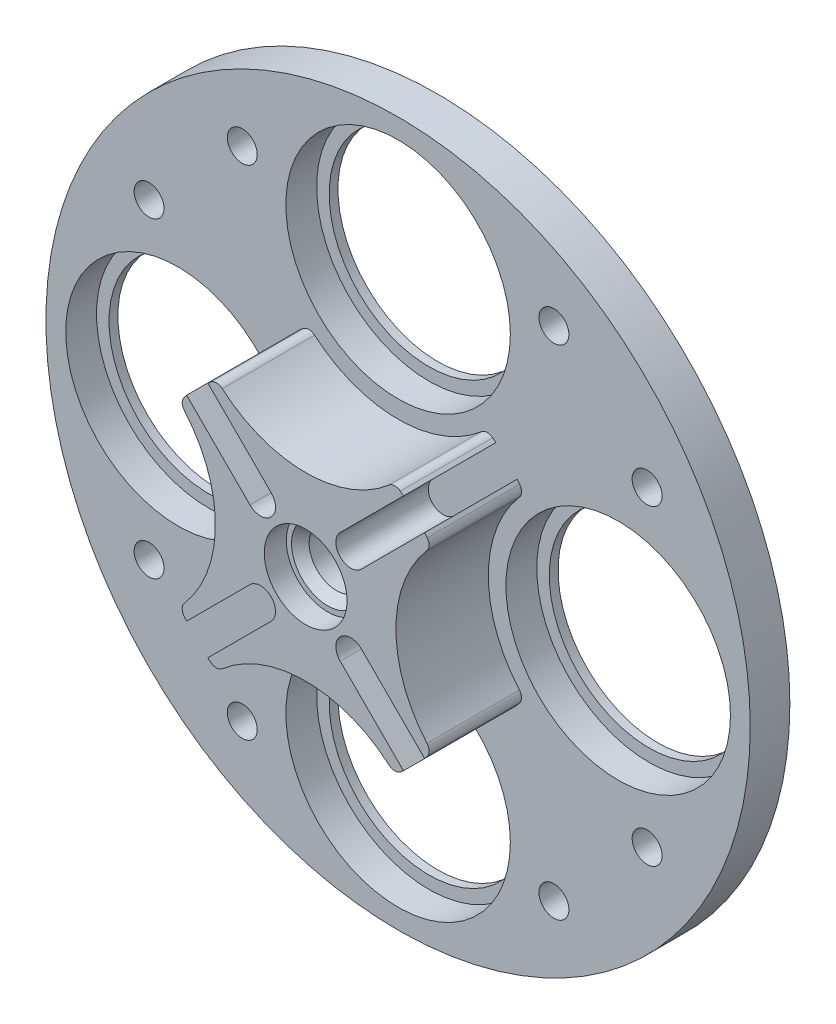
from build123d import *

# Parameters (mm, degrees)
SKETCH2_R           = 40
SKETCH2_R_2         = 11.33
SKETCH2_R_3         = 3.1
SKETCH2_R_4         = 1.7
BOSS_EXTRUDE1_DEPTH = 1
SKETCH3_R           = 40
SKETCH3_R_2         = 12.75
SKETCH3_R_3         = 3.1
SKETCH3_R_4         = 1.7
BOSS_EXTRUDE2_DEPTH = 3.5
SKETCH4_R           = 3.1
BOSS_EXTRUDE3_DEPTH = 10.5
SKETCH6_R           = 4.7
CUT_EXTRUDE2_DEPTH  = 2.5
CHAMFER1_SIZE       = 1
CUT_EXTRUDE1_DEPTH  = 2.1
FILLET1_R           = 1


with BuildPart() as part:
    # Sketch2 → Boss-Extrude1 (new body)
    with BuildSketch(Plane.XY):
        Circle(SKETCH2_R)
        with Locations((0, 25)):
            Circle(SKETCH2_R_2, mode=Mode.SUBTRACT)
        with Locations((25, 0)):
            Circle(SKETCH2_R_2, mode=Mode.SUBTRACT)
        with Locations((0, -25)):
            Circle(SKETCH2_R_2, mode=Mode.SUBTRACT)
        with Locations((-25, 0)):
            Circle(SKETCH2_R_2, mode=Mode.SUBTRACT)
        Circle(SKETCH2_R_3, mode=Mode.SUBTRACT)
        with Locations((17.697840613, 28.284271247)):
            Circle(SKETCH2_R_4, mode=Mode.SUBTRACT)
        with Locations((-17.697840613, 28.284271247)):
            Circle(SKETCH2_R_4, mode=Mode.SUBTRACT)
        with Locations((28.284271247, -17.697840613)):
            Circle(SKETCH2_R_4, mode=Mode.SUBTRACT)
        with Locations((28.284271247, 17.697840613)):
            Circle(SKETCH2_R_4, mode=Mode.SUBTRACT)
        with Locations((-17.697840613, -28.284271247)):
            Circle(SKETCH2_R_4, mode=Mode.SUBTRACT)
        with Locations((17.697840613, -28.284271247)):
            Circle(SKETCH2_R_4, mode=Mode.SUBTRACT)
        with Locations((-28.284271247, 17.697840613)):
            Circle(SKETCH2_R_4, mode=Mode.SUBTRACT)
        with Locations((-28.284271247, -17.697840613)):
            Circle(SKETCH2_R_4, mode=Mode.SUBTRACT)
    extrude(amount=BOSS_EXTRUDE1_DEPTH)

    # Sketch3 → Boss-Extrude2 (add)
    with BuildSketch(Plane.XY.offset(1)):
        Circle(SKETCH3_R)
        with Locations((0, 25)):
            Circle(SKETCH3_R_2, mode=Mode.SUBTRACT)
        with Locations((25, 0)):
            Circle(SKETCH3_R_2, mode=Mode.SUBTRACT)
        with Locations((0, -25)):
            Circle(SKETCH3_R_2, mode=Mode.SUBTRACT)
        with Locations((-25, 0)):
            Circle(SKETCH3_R_2, mode=Mode.SUBTRACT)
        Circle(SKETCH3_R_3, mode=Mode.SUBTRACT)
        with Locations((17.697840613, 28.284271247)):
            Circle(SKETCH3_R_4, mode=Mode.SUBTRACT)
        with Locations((-17.697840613, 28.284271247)):
            Circle(SKETCH3_R_4, mode=Mode.SUBTRACT)
        with Locations((28.284271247, -17.697840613)):
            Circle(SKETCH3_R_4, mode=Mode.SUBTRACT)
        with Locations((28.284271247, 17.697840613)):
            Circle(SKETCH3_R_4, mode=Mode.SUBTRACT)
        with Locations((-17.697840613, -28.284271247)):
            Circle(SKETCH3_R_4, mode=Mode.SUBTRACT)
        with Locations((17.697840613, -28.284271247)):
            Circle(SKETCH3_R_4, mode=Mode.SUBTRACT)
        with Locations((-28.284271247, 17.697840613)):
            Circle(SKETCH3_R_4, mode=Mode.SUBTRACT)
        with Locations((-28.284271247, -17.697840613)):
            Circle(SKETCH3_R_4, mode=Mode.SUBTRACT)
    extrude(amount=BOSS_EXTRUDE2_DEPTH)

    # Sketch4 → Boss-Extrude3 (add)
    with BuildSketch(Plane.XY.offset(4.5)):
        with BuildLine():
            Line((11.113761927, 13.517924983), (3.923549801, 6.327712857))
            ThreePointArc((3.923549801, 6.327712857), (3.923549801, 3.923549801), (6.327712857, 3.923549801))
            Line((6.327712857, 3.923549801), (13.517924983, 11.113761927))
            ThreePointArc((13.517924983, 11.113761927), (13.925714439, 10.598324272), (14.313861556, 10.067937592))
            ThreePointArc((14.313861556, 10.067937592), (10.248737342, 0), (14.313861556, -10.067937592))
            ThreePointArc((14.313861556, -10.067937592), (13.925714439, -10.598324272), (13.517924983, -11.113761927))
            Line((13.517924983, -11.113761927), (6.327712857, -3.923549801))
            ThreePointArc((6.327712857, -3.923549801), (3.923549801, -3.923549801), (3.923549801, -6.327712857))
            Line((3.923549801, -6.327712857), (11.113761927, -13.517924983))
            ThreePointArc((11.113761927, -13.517924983), (10.598324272, -13.925714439), (10.067937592, -14.313861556))
            ThreePointArc((10.067937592, -14.313861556), (0, -10.248737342), (-10.067937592, -14.313861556))
            ThreePointArc((-10.067937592, -14.313861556), (-10.598324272, -13.925714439), (-11.113761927, -13.517924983))
            Line((-11.113761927, -13.517924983), (-3.923549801, -6.327712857))
            ThreePointArc((-3.923549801, -6.327712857), (-3.923549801, -3.923549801), (-6.327712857, -3.923549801))
            Line((-6.327712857, -3.923549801), (-13.517924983, -11.113761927))
            ThreePointArc((-13.517924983, -11.113761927), (-13.925714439, -10.598324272), (-14.313861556, -10.067937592))
            ThreePointArc((-14.313861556, -10.067937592), (-10.248737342, 0), (-14.313861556, 10.067937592))
            ThreePointArc((-14.313861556, 10.067937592), (-13.925714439, 10.598324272), (-13.517924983, 11.113761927))
            Line((-13.517924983, 11.113761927), (-6.327712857, 3.923549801))
            ThreePointArc((-6.327712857, 3.923549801), (-3.923549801, 3.923549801), (-3.923549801, 6.327712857))
            Line((-3.923549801, 6.327712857), (-11.113761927, 13.517924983))
            ThreePointArc((-11.113761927, 13.517924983), (-10.598324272, 13.925714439), (-10.067937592, 14.313861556))
            ThreePointArc((-10.067937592, 14.313861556), (0, 10.248737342), (10.067937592, 14.313861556))
            ThreePointArc((10.067937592, 14.313861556), (10.598324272, 13.925714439), (11.113761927, 13.517924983))
        make_face()
        Circle(SKETCH4_R, mode=Mode.SUBTRACT)
    extrude(amount=BOSS_EXTRUDE3_DEPTH)

    # Sketch6 → Cut-Extrude2 (cut)
    with BuildSketch(Plane.XY.offset(15)):
        Circle(SKETCH6_R)
    extrude(amount=-CUT_EXTRUDE2_DEPTH, mode=Mode.SUBTRACT)

    # Chamfer1
    chamfer1_edges = [part.edges().sort_by_distance(p)[0] for p in [
        (-3.1, 0, 12.5),
    ]]
    chamfer(chamfer1_edges, length=CHAMFER1_SIZE)

    # Sketch5 → Cut-Extrude1 (cut)
    with BuildSketch(Plane(origin=(0, 0, 0), x_dir=(-1, 0, 0), z_dir=(0, 0, -1))):
        Polygon((29.929719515, 14.847840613), (31.575167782, 17.697840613), (29.929719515, 20.547840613), (26.63882298, 20.547840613), (24.993374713, 17.697840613), (26.63882298, 14.847840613), align=None)
        Polygon((-14.847840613, 29.929719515), (-17.697840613, 31.575167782), (-20.547840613, 29.929719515), (-20.547840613, 26.63882298), (-17.697840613, 24.993374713), (-14.847840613, 26.63882298), align=None)
        Polygon((20.547840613, 26.63882298), (20.547840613, 29.929719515), (17.697840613, 31.575167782), (14.847840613, 29.929719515), (14.847840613, 26.63882298), (17.697840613, 24.993374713), align=None)
        Polygon((26.63882298, -20.547840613), (29.929719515, -20.547840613), (31.575167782, -17.697840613), (29.929719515, -14.847840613), (26.63882298, -14.847840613), (24.993374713, -17.697840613), align=None)
        Polygon((14.847840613, -29.929719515), (17.697840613, -31.575167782), (20.547840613, -29.929719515), (20.547840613, -26.63882298), (17.697840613, -24.993374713), (14.847840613, -26.63882298), align=None)
        Polygon((-20.547840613, -26.63882298), (-20.547840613, -29.929719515), (-17.697840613, -31.575167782), (-14.847840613, -29.929719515), (-14.847840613, -26.63882298), (-17.697840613, -24.993374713), align=None)
        Polygon((-29.929719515, -14.847840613), (-31.575167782, -17.697840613), (-29.929719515, -20.547840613), (-26.63882298, -20.547840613), (-24.993374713, -17.697840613), (-26.63882298, -14.847840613), align=None)
        Polygon((-26.63882298, 20.547840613), (-29.929719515, 20.547840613), (-31.575167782, 17.697840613), (-29.929719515, 14.847840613), (-26.63882298, 14.847840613), (-24.993374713, 17.697840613), align=None)
    extrude(amount=-CUT_EXTRUDE1_DEPTH, mode=Mode.SUBTRACT)

    # Fillet1
    fillet1_edges = [part.edges().sort_by_distance(p)[0] for p in [
        (14.313861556, -10.067937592, 9.75),
        (14.313861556, 10.067937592, 9.75),
        (10.067937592, 14.313861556, 9.75),
        (-10.067937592, 14.313861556, 9.75),
        (-14.313861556, 10.067937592, 9.75),
        (-14.313861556, -10.067937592, 9.75),
        (-10.067937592, -14.313861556, 9.75),
        (10.067937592, -14.313861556, 9.75),
    ]]
    fillet(fillet1_edges, radius=FILLET1_R)


solid = part.part
